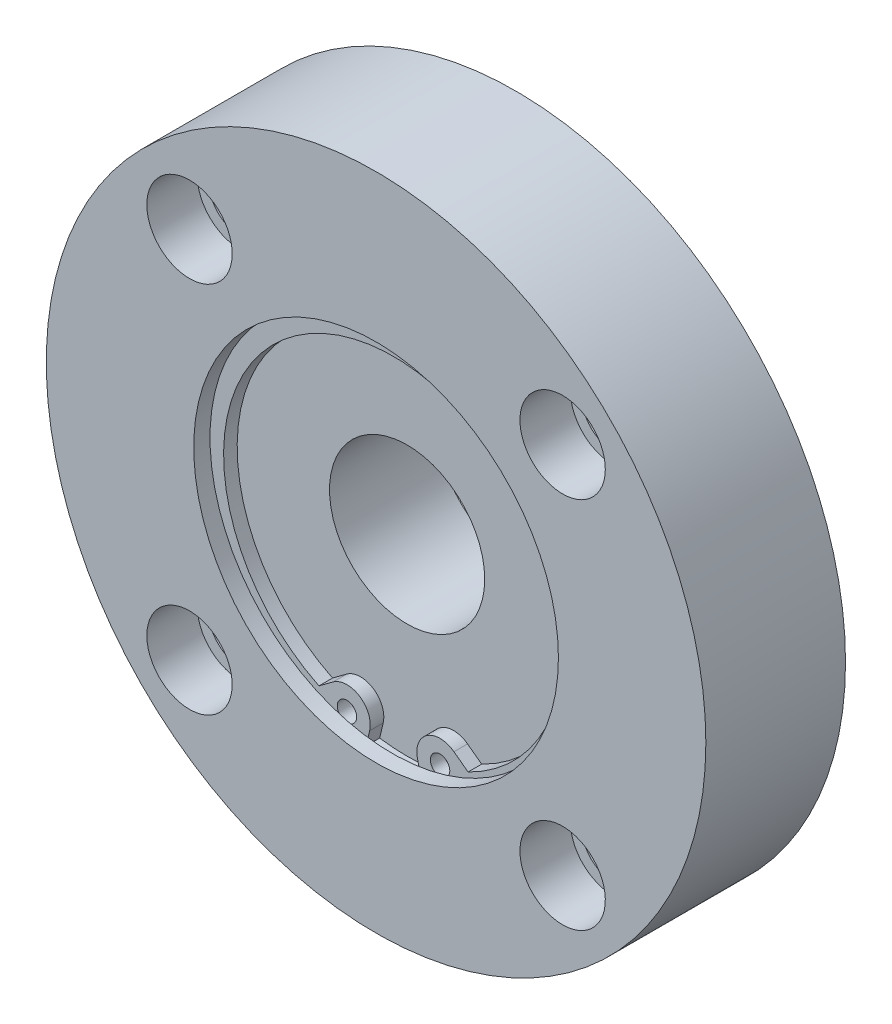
ISO-10303-21;
HEADER;
FILE_DESCRIPTION(('STEP AP214'),'2;1');
FILE_NAME('part.step','',(''),(''),'','','');
FILE_SCHEMA(('AUTOMOTIVE_DESIGN { 1 0 10303 214 1 1 1 1 }'));
ENDSEC;
DATA;
#1=APPLICATION_CONTEXT('core data for automotive mechanical design processes');
#2=APPLICATION_PROTOCOL_DEFINITION('international standard','automotive_design',2000,#1);
#3=PRODUCT_CONTEXT('',#1,'mechanical');
#4=PRODUCT('Part','Part','',(#3));
#5=PRODUCT_RELATED_PRODUCT_CATEGORY('part','',(#4));
#6=PRODUCT_DEFINITION_FORMATION('','',#4);
#7=PRODUCT_DEFINITION_CONTEXT('part definition',#1,'design');
#8=PRODUCT_DEFINITION('design','',#6,#7);
#9=PRODUCT_DEFINITION_SHAPE('','',#8);
#10=(LENGTH_UNIT() NAMED_UNIT(*) SI_UNIT(.MILLI.,.METRE.));
#11=(NAMED_UNIT(*) PLANE_ANGLE_UNIT() SI_UNIT($,.RADIAN.));
#12=(NAMED_UNIT(*) SI_UNIT($,.STERADIAN.) SOLID_ANGLE_UNIT());
#13=UNCERTAINTY_MEASURE_WITH_UNIT(LENGTH_MEASURE(1.E-05),#10,'distance_accuracy_value','');
#14=(GEOMETRIC_REPRESENTATION_CONTEXT(3) GLOBAL_UNCERTAINTY_ASSIGNED_CONTEXT((#13)) GLOBAL_UNIT_ASSIGNED_CONTEXT((#10,
#11,#12)) REPRESENTATION_CONTEXT('',''));
#15=CARTESIAN_POINT('',(0.,0.,0.));
#16=DIRECTION('',(0.,0.,1.));
#17=DIRECTION('',(1.,0.,0.));
#18=AXIS2_PLACEMENT_3D('',#15,#16,#17);
#19=CARTESIAN_POINT('',(24.0416305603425,24.0416305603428,0.));
#20=DIRECTION('',(0.,0.,1.));
#21=DIRECTION('',(1.,0.,0.));
#22=AXIS2_PLACEMENT_3D('',#19,#20,#21);
#23=CYLINDRICAL_SURFACE('',#22,4.);
#24=CARTESIAN_POINT('',(24.0416305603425,24.0416305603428,0.));
#25=DIRECTION('',(0.,0.,1.));
#26=DIRECTION('',(1.,0.,0.));
#27=AXIS2_PLACEMENT_3D('',#24,#25,#26);
#28=CIRCLE('',#27,4.);
#29=CARTESIAN_POINT('',(28.0416305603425,24.0416305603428,0.));
#30=VERTEX_POINT('',#29);
#31=EDGE_CURVE('E225',#30,#30,#28,.T.);
#32=ORIENTED_EDGE('',*,*,#31,.F.);
#33=EDGE_LOOP('',(#32));
#34=FACE_BOUND('',#33,.T.);
#35=CARTESIAN_POINT('',(24.0416305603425,24.0416305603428,11.5));
#36=DIRECTION('',(0.,0.,1.));
#37=DIRECTION('',(1.,0.,0.));
#38=AXIS2_PLACEMENT_3D('',#35,#36,#37);
#39=CIRCLE('',#38,4.);
#40=CARTESIAN_POINT('',(28.0416305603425,24.0416305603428,11.5));
#41=VERTEX_POINT('',#40);
#42=EDGE_CURVE('E224',#41,#41,#39,.F.);
#43=ORIENTED_EDGE('',*,*,#42,.F.);
#44=EDGE_LOOP('',(#43));
#45=FACE_BOUND('',#44,.T.);
#46=ADVANCED_FACE('F14',(#34,#45),#23,.F.);
#47=CARTESIAN_POINT('',(24.0416305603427,-24.0416305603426,0.));
#48=DIRECTION('',(0.,0.,1.));
#49=DIRECTION('',(1.,0.,0.));
#50=AXIS2_PLACEMENT_3D('',#47,#48,#49);
#51=CYLINDRICAL_SURFACE('',#50,4.);
#52=CARTESIAN_POINT('',(24.0416305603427,-24.0416305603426,0.));
#53=DIRECTION('',(0.,0.,1.));
#54=DIRECTION('',(0.,-1.,0.));
#55=AXIS2_PLACEMENT_3D('',#52,#53,#54);
#56=CIRCLE('',#55,4.);
#57=CARTESIAN_POINT('',(24.0416305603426,-28.0416305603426,0.));
#58=VERTEX_POINT('',#57);
#59=EDGE_CURVE('E215',#58,#58,#56,.T.);
#60=ORIENTED_EDGE('',*,*,#59,.F.);
#61=EDGE_LOOP('',(#60));
#62=FACE_BOUND('',#61,.T.);
#63=CARTESIAN_POINT('',(24.0416305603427,-24.0416305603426,11.5));
#64=DIRECTION('',(0.,0.,1.));
#65=DIRECTION('',(1.,0.,0.));
#66=AXIS2_PLACEMENT_3D('',#63,#64,#65);
#67=CIRCLE('',#66,4.);
#68=CARTESIAN_POINT('',(28.0416305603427,-24.0416305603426,11.5));
#69=VERTEX_POINT('',#68);
#70=EDGE_CURVE('E208',#69,#69,#67,.F.);
#71=ORIENTED_EDGE('',*,*,#70,.F.);
#72=EDGE_LOOP('',(#71));
#73=FACE_BOUND('',#72,.T.);
#74=ADVANCED_FACE('F339',(#62,#73),#51,.F.);
#75=CARTESIAN_POINT('',(-24.0416305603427,-24.0416305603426,0.));
#76=DIRECTION('',(0.,0.,1.));
#77=DIRECTION('',(1.,0.,0.));
#78=AXIS2_PLACEMENT_3D('',#75,#76,#77);
#79=CYLINDRICAL_SURFACE('',#78,4.);
#80=CARTESIAN_POINT('',(-24.0416305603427,-24.0416305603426,0.));
#81=DIRECTION('',(0.,0.,1.));
#82=DIRECTION('',(-1.,0.,0.));
#83=AXIS2_PLACEMENT_3D('',#80,#81,#82);
#84=CIRCLE('',#83,4.);
#85=CARTESIAN_POINT('',(-28.0416305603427,-24.0416305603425,0.));
#86=VERTEX_POINT('',#85);
#87=EDGE_CURVE('E212',#86,#86,#84,.T.);
#88=ORIENTED_EDGE('',*,*,#87,.F.);
#89=EDGE_LOOP('',(#88));
#90=FACE_BOUND('',#89,.T.);
#91=CARTESIAN_POINT('',(-24.0416305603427,-24.0416305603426,11.5));
#92=DIRECTION('',(0.,0.,1.));
#93=DIRECTION('',(1.,0.,0.));
#94=AXIS2_PLACEMENT_3D('',#91,#92,#93);
#95=CIRCLE('',#94,4.);
#96=CARTESIAN_POINT('',(-20.0416305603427,-24.0416305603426,11.5));
#97=VERTEX_POINT('',#96);
#98=EDGE_CURVE('E201',#97,#97,#95,.F.);
#99=ORIENTED_EDGE('',*,*,#98,.F.);
#100=EDGE_LOOP('',(#99));
#101=FACE_BOUND('',#100,.T.);
#102=ADVANCED_FACE('F352',(#90,#101),#79,.F.);
#103=CARTESIAN_POINT('',(-24.0416305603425,24.0416305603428,0.));
#104=DIRECTION('',(0.,0.,1.));
#105=DIRECTION('',(1.,0.,0.));
#106=AXIS2_PLACEMENT_3D('',#103,#104,#105);
#107=CYLINDRICAL_SURFACE('',#106,4.);
#108=CARTESIAN_POINT('',(-24.0416305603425,24.0416305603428,0.));
#109=DIRECTION('',(0.,0.,1.));
#110=DIRECTION('',(0.,1.,0.));
#111=AXIS2_PLACEMENT_3D('',#108,#109,#110);
#112=CIRCLE('',#111,4.);
#113=CARTESIAN_POINT('',(-24.0416305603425,28.0416305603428,0.));
#114=VERTEX_POINT('',#113);
#115=EDGE_CURVE('E209',#114,#114,#112,.T.);
#116=ORIENTED_EDGE('',*,*,#115,.F.);
#117=EDGE_LOOP('',(#116));
#118=FACE_BOUND('',#117,.T.);
#119=CARTESIAN_POINT('',(-24.0416305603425,24.0416305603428,11.5));
#120=DIRECTION('',(0.,0.,1.));
#121=DIRECTION('',(1.,0.,0.));
#122=AXIS2_PLACEMENT_3D('',#119,#120,#121);
#123=CIRCLE('',#122,4.);
#124=CARTESIAN_POINT('',(-20.0416305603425,24.0416305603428,11.5));
#125=VERTEX_POINT('',#124);
#126=EDGE_CURVE('E194',#125,#125,#123,.F.);
#127=ORIENTED_EDGE('',*,*,#126,.F.);
#128=EDGE_LOOP('',(#127));
#129=FACE_BOUND('',#128,.T.);
#130=ADVANCED_FACE('F356',(#118,#129),#107,.F.);
#131=CARTESIAN_POINT('',(0.,0.,-5.));
#132=DIRECTION('',(0.,0.,1.));
#133=DIRECTION('',(1.,0.,0.));
#134=AXIS2_PLACEMENT_3D('',#131,#132,#133);
#135=CYLINDRICAL_SURFACE('',#134,27.);
#136=CARTESIAN_POINT('',(0.,0.,-5.));
#137=DIRECTION('',(0.,0.,-1.));
#138=DIRECTION('',(-1.,0.,0.));
#139=AXIS2_PLACEMENT_3D('',#136,#137,#138);
#140=CIRCLE('',#139,27.);
#141=CARTESIAN_POINT('',(-27.,0.,-5.));
#142=VERTEX_POINT('',#141);
#143=EDGE_CURVE('E176',#142,#142,#140,.T.);
#144=ORIENTED_EDGE('',*,*,#143,.F.);
#145=EDGE_LOOP('',(#144));
#146=FACE_BOUND('',#145,.T.);
#147=CARTESIAN_POINT('',(0.,0.,0.));
#148=DIRECTION('',(0.,0.,-1.));
#149=DIRECTION('',(-1.,0.,0.));
#150=AXIS2_PLACEMENT_3D('',#147,#148,#149);
#151=CIRCLE('',#150,27.);
#152=CARTESIAN_POINT('',(-27.,0.,0.));
#153=VERTEX_POINT('',#152);
#154=EDGE_CURVE('E177',#153,#153,#151,.T.);
#155=ORIENTED_EDGE('',*,*,#154,.T.);
#156=EDGE_LOOP('',(#155));
#157=FACE_BOUND('',#156,.T.);
#158=ADVANCED_FACE('F360',(#146,#157),#135,.T.);
#159=CARTESIAN_POINT('',(0.,0.,0.));
#160=DIRECTION('',(0.,0.,1.));
#161=DIRECTION('',(1.,0.,0.));
#162=AXIS2_PLACEMENT_3D('',#159,#160,#161);
#163=PLANE('',#162);
#164=ORIENTED_EDGE('',*,*,#115,.T.);
#165=EDGE_LOOP('',(#164));
#166=FACE_BOUND('',#165,.T.);
#167=ORIENTED_EDGE('',*,*,#87,.T.);
#168=EDGE_LOOP('',(#167));
#169=FACE_BOUND('',#168,.T.);
#170=ORIENTED_EDGE('',*,*,#59,.T.);
#171=EDGE_LOOP('',(#170));
#172=FACE_BOUND('',#171,.T.);
#173=ORIENTED_EDGE('',*,*,#31,.T.);
#174=EDGE_LOOP('',(#173));
#175=FACE_BOUND('',#174,.T.);
#176=CARTESIAN_POINT('',(0.,0.,0.));
#177=DIRECTION('',(0.,0.,1.));
#178=DIRECTION('',(1.,0.,0.));
#179=AXIS2_PLACEMENT_3D('',#176,#177,#178);
#180=CIRCLE('',#179,42.5);
#181=CARTESIAN_POINT('',(42.5,0.,0.));
#182=VERTEX_POINT('',#181);
#183=EDGE_CURVE('E231',#182,#182,#180,.T.);
#184=ORIENTED_EDGE('',*,*,#183,.F.);
#185=EDGE_LOOP('',(#184));
#186=FACE_BOUND('',#185,.T.);
#187=ORIENTED_EDGE('',*,*,#154,.F.);
#188=EDGE_LOOP('',(#187));
#189=FACE_BOUND('',#188,.T.);
#190=ADVANCED_FACE('F332',(#166,#169,#172,#175,#186,#189),#163,.F.);
#191=CARTESIAN_POINT('',(24.0416305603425,24.0416305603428,11.5));
#192=DIRECTION('',(0.,0.,1.));
#193=DIRECTION('',(1.,0.,0.));
#194=AXIS2_PLACEMENT_3D('',#191,#192,#193);
#195=PLANE('',#194);
#196=CARTESIAN_POINT('',(24.0416305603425,24.0416305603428,11.5));
#197=DIRECTION('',(0.,0.,1.));
#198=DIRECTION('',(1.,0.,0.));
#199=AXIS2_PLACEMENT_3D('',#196,#197,#198);
#200=CIRCLE('',#199,5.5);
#201=CARTESIAN_POINT('',(29.5416305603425,24.0416305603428,11.5));
#202=VERTEX_POINT('',#201);
#203=EDGE_CURVE('E221',#202,#202,#200,.T.);
#204=ORIENTED_EDGE('',*,*,#203,.T.);
#205=EDGE_LOOP('',(#204));
#206=FACE_BOUND('',#205,.T.);
#207=ORIENTED_EDGE('',*,*,#42,.T.);
#208=EDGE_LOOP('',(#207));
#209=FACE_BOUND('',#208,.T.);
#210=ADVANCED_FACE('F345',(#206,#209),#195,.T.);
#211=CARTESIAN_POINT('',(24.0416305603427,-24.0416305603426,11.5));
#212=DIRECTION('',(0.,0.,1.));
#213=DIRECTION('',(0.,-1.,0.));
#214=AXIS2_PLACEMENT_3D('',#211,#212,#213);
#215=PLANE('',#214);
#216=CARTESIAN_POINT('',(24.0416305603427,-24.0416305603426,11.5));
#217=DIRECTION('',(0.,0.,1.));
#218=DIRECTION('',(0.,-1.,0.));
#219=AXIS2_PLACEMENT_3D('',#216,#217,#218);
#220=CIRCLE('',#219,5.5);
#221=CARTESIAN_POINT('',(24.0416305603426,-29.5416305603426,11.5));
#222=VERTEX_POINT('',#221);
#223=EDGE_CURVE('E205',#222,#222,#220,.T.);
#224=ORIENTED_EDGE('',*,*,#223,.T.);
#225=EDGE_LOOP('',(#224));
#226=FACE_BOUND('',#225,.T.);
#227=ORIENTED_EDGE('',*,*,#70,.T.);
#228=EDGE_LOOP('',(#227));
#229=FACE_BOUND('',#228,.T.);
#230=ADVANCED_FACE('F348',(#226,#229),#215,.T.);
#231=CARTESIAN_POINT('',(-24.0416305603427,-24.0416305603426,11.5));
#232=DIRECTION('',(0.,0.,1.));
#233=DIRECTION('',(-1.,0.,0.));
#234=AXIS2_PLACEMENT_3D('',#231,#232,#233);
#235=PLANE('',#234);
#236=CARTESIAN_POINT('',(-24.0416305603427,-24.0416305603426,11.5));
#237=DIRECTION('',(0.,0.,1.));
#238=DIRECTION('',(-1.,0.,0.));
#239=AXIS2_PLACEMENT_3D('',#236,#237,#238);
#240=CIRCLE('',#239,5.5);
#241=CARTESIAN_POINT('',(-29.5416305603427,-24.0416305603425,11.5));
#242=VERTEX_POINT('',#241);
#243=EDGE_CURVE('E198',#242,#242,#240,.T.);
#244=ORIENTED_EDGE('',*,*,#243,.T.);
#245=EDGE_LOOP('',(#244));
#246=FACE_BOUND('',#245,.T.);
#247=ORIENTED_EDGE('',*,*,#98,.T.);
#248=EDGE_LOOP('',(#247));
#249=FACE_BOUND('',#248,.T.);
#250=ADVANCED_FACE('F368',(#246,#249),#235,.T.);
#251=CARTESIAN_POINT('',(-24.0416305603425,24.0416305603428,11.5));
#252=DIRECTION('',(0.,0.,1.));
#253=DIRECTION('',(0.,1.,0.));
#254=AXIS2_PLACEMENT_3D('',#251,#252,#253);
#255=PLANE('',#254);
#256=CARTESIAN_POINT('',(-24.0416305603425,24.0416305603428,11.5));
#257=DIRECTION('',(0.,0.,1.));
#258=DIRECTION('',(0.,1.,0.));
#259=AXIS2_PLACEMENT_3D('',#256,#257,#258);
#260=CIRCLE('',#259,5.5);
#261=CARTESIAN_POINT('',(-24.0416305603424,29.5416305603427,11.5));
#262=VERTEX_POINT('',#261);
#263=EDGE_CURVE('E191',#262,#262,#260,.T.);
#264=ORIENTED_EDGE('',*,*,#263,.T.);
#265=EDGE_LOOP('',(#264));
#266=FACE_BOUND('',#265,.T.);
#267=ORIENTED_EDGE('',*,*,#126,.T.);
#268=EDGE_LOOP('',(#267));
#269=FACE_BOUND('',#268,.T.);
#270=ADVANCED_FACE('F376',(#266,#269),#255,.T.);
#271=CARTESIAN_POINT('',(0.,0.,-5.));
#272=DIRECTION('',(0.,0.,-1.));
#273=DIRECTION('',(-1.,0.,0.));
#274=AXIS2_PLACEMENT_3D('',#271,#272,#273);
#275=PLANE('',#274);
#276=ORIENTED_EDGE('',*,*,#143,.T.);
#277=EDGE_LOOP('',(#276));
#278=FACE_BOUND('',#277,.T.);
#279=CARTESIAN_POINT('',(0.,0.,-5.));
#280=DIRECTION('',(0.,0.,-1.));
#281=DIRECTION('',(-1.,0.,0.));
#282=AXIS2_PLACEMENT_3D('',#279,#280,#281);
#283=CIRCLE('',#282,20.);
#284=CARTESIAN_POINT('',(-20.,0.,-5.));
#285=VERTEX_POINT('',#284);
#286=EDGE_CURVE('E173',#285,#285,#283,.T.);
#287=ORIENTED_EDGE('',*,*,#286,.F.);
#288=EDGE_LOOP('',(#287));
#289=FACE_BOUND('',#288,.T.);
#290=ADVANCED_FACE('F320',(#278,#289),#275,.T.);
#291=CARTESIAN_POINT('',(0.,0.,18.));
#292=DIRECTION('',(0.,0.,-1.));
#293=DIRECTION('',(-1.,0.,0.));
#294=AXIS2_PLACEMENT_3D('',#291,#292,#293);
#295=CYLINDRICAL_SURFACE('',#294,42.5);
#296=CARTESIAN_POINT('',(0.,0.,18.));
#297=DIRECTION('',(0.,0.,1.));
#298=DIRECTION('',(1.,0.,0.));
#299=AXIS2_PLACEMENT_3D('',#296,#297,#298);
#300=CIRCLE('',#299,42.5);
#301=CARTESIAN_POINT('',(42.5,0.,18.));
#302=VERTEX_POINT('',#301);
#303=EDGE_CURVE('E181',#302,#302,#300,.T.);
#304=ORIENTED_EDGE('',*,*,#303,.F.);
#305=EDGE_LOOP('',(#304));
#306=FACE_BOUND('',#305,.T.);
#307=ORIENTED_EDGE('',*,*,#183,.T.);
#308=EDGE_LOOP('',(#307));
#309=FACE_BOUND('',#308,.T.);
#310=ADVANCED_FACE('F316',(#306,#309),#295,.T.);
#311=CARTESIAN_POINT('',(24.0416305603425,24.0416305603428,11.5));
#312=DIRECTION('',(0.,0.,1.));
#313=DIRECTION('',(1.,0.,0.));
#314=AXIS2_PLACEMENT_3D('',#311,#312,#313);
#315=CYLINDRICAL_SURFACE('',#314,5.5);
#316=ORIENTED_EDGE('',*,*,#203,.F.);
#317=EDGE_LOOP('',(#316));
#318=FACE_BOUND('',#317,.T.);
#319=CARTESIAN_POINT('',(24.0416305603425,24.0416305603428,18.));
#320=DIRECTION('',(0.,0.,1.));
#321=DIRECTION('',(1.,0.,0.));
#322=AXIS2_PLACEMENT_3D('',#319,#320,#321);
#323=CIRCLE('',#322,5.5);
#324=CARTESIAN_POINT('',(29.5416305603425,24.0416305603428,18.));
#325=VERTEX_POINT('',#324);
#326=EDGE_CURVE('E218',#325,#325,#323,.T.);
#327=ORIENTED_EDGE('',*,*,#326,.T.);
#328=EDGE_LOOP('',(#327));
#329=FACE_BOUND('',#328,.T.);
#330=ADVANCED_FACE('F319',(#318,#329),#315,.F.);
#331=CARTESIAN_POINT('',(24.0416305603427,-24.0416305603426,11.5));
#332=DIRECTION('',(0.,0.,1.));
#333=DIRECTION('',(1.,0.,0.));
#334=AXIS2_PLACEMENT_3D('',#331,#332,#333);
#335=CYLINDRICAL_SURFACE('',#334,5.5);
#336=ORIENTED_EDGE('',*,*,#223,.F.);
#337=EDGE_LOOP('',(#336));
#338=FACE_BOUND('',#337,.T.);
#339=CARTESIAN_POINT('',(24.0416305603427,-24.0416305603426,18.));
#340=DIRECTION('',(0.,0.,1.));
#341=DIRECTION('',(0.,-1.,0.));
#342=AXIS2_PLACEMENT_3D('',#339,#340,#341);
#343=CIRCLE('',#342,5.5);
#344=CARTESIAN_POINT('',(24.0416305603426,-29.5416305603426,18.));
#345=VERTEX_POINT('',#344);
#346=EDGE_CURVE('E202',#345,#345,#343,.T.);
#347=ORIENTED_EDGE('',*,*,#346,.T.);
#348=EDGE_LOOP('',(#347));
#349=FACE_BOUND('',#348,.T.);
#350=ADVANCED_FACE('F343',(#338,#349),#335,.F.);
#351=CARTESIAN_POINT('',(-24.0416305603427,-24.0416305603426,11.5));
#352=DIRECTION('',(0.,0.,1.));
#353=DIRECTION('',(1.,0.,0.));
#354=AXIS2_PLACEMENT_3D('',#351,#352,#353);
#355=CYLINDRICAL_SURFACE('',#354,5.5);
#356=ORIENTED_EDGE('',*,*,#243,.F.);
#357=EDGE_LOOP('',(#356));
#358=FACE_BOUND('',#357,.T.);
#359=CARTESIAN_POINT('',(-24.0416305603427,-24.0416305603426,18.));
#360=DIRECTION('',(0.,0.,1.));
#361=DIRECTION('',(-1.,0.,0.));
#362=AXIS2_PLACEMENT_3D('',#359,#360,#361);
#363=CIRCLE('',#362,5.5);
#364=CARTESIAN_POINT('',(-29.5416305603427,-24.0416305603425,18.));
#365=VERTEX_POINT('',#364);
#366=EDGE_CURVE('E195',#365,#365,#363,.T.);
#367=ORIENTED_EDGE('',*,*,#366,.T.);
#368=EDGE_LOOP('',(#367));
#369=FACE_BOUND('',#368,.T.);
#370=ADVANCED_FACE('F364',(#358,#369),#355,.F.);
#371=CARTESIAN_POINT('',(-24.0416305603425,24.0416305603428,11.5));
#372=DIRECTION('',(0.,0.,1.));
#373=DIRECTION('',(1.,0.,0.));
#374=AXIS2_PLACEMENT_3D('',#371,#372,#373);
#375=CYLINDRICAL_SURFACE('',#374,5.5);
#376=ORIENTED_EDGE('',*,*,#263,.F.);
#377=EDGE_LOOP('',(#376));
#378=FACE_BOUND('',#377,.T.);
#379=CARTESIAN_POINT('',(-24.0416305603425,24.0416305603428,18.));
#380=DIRECTION('',(0.,0.,1.));
#381=DIRECTION('',(0.,1.,0.));
#382=AXIS2_PLACEMENT_3D('',#379,#380,#381);
#383=CIRCLE('',#382,5.5);
#384=CARTESIAN_POINT('',(-24.0416305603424,29.5416305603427,18.));
#385=VERTEX_POINT('',#384);
#386=EDGE_CURVE('E188',#385,#385,#383,.T.);
#387=ORIENTED_EDGE('',*,*,#386,.T.);
#388=EDGE_LOOP('',(#387));
#389=FACE_BOUND('',#388,.T.);
#390=ADVANCED_FACE('F372',(#378,#389),#375,.F.);
#391=CARTESIAN_POINT('',(0.,0.,-5.));
#392=DIRECTION('',(0.,0.,1.));
#393=DIRECTION('',(1.,0.,0.));
#394=AXIS2_PLACEMENT_3D('',#391,#392,#393);
#395=CYLINDRICAL_SURFACE('',#394,20.);
#396=ORIENTED_EDGE('',*,*,#286,.T.);
#397=EDGE_LOOP('',(#396));
#398=FACE_BOUND('',#397,.T.);
#399=CARTESIAN_POINT('',(0.,0.,0.));
#400=DIRECTION('',(0.,0.,-1.));
#401=DIRECTION('',(-1.,0.,0.));
#402=AXIS2_PLACEMENT_3D('',#399,#400,#401);
#403=CIRCLE('',#402,20.);
#404=CARTESIAN_POINT('',(-20.,0.,0.));
#405=VERTEX_POINT('',#404);
#406=EDGE_CURVE('E170',#405,#405,#403,.T.);
#407=ORIENTED_EDGE('',*,*,#406,.F.);
#408=EDGE_LOOP('',(#407));
#409=FACE_BOUND('',#408,.T.);
#410=ADVANCED_FACE('F326',(#398,#409),#395,.F.);
#411=CARTESIAN_POINT('',(0.,0.,18.));
#412=DIRECTION('',(0.,0.,1.));
#413=DIRECTION('',(1.,0.,0.));
#414=AXIS2_PLACEMENT_3D('',#411,#412,#413);
#415=PLANE('',#414);
#416=CARTESIAN_POINT('',(0.,0.,18.));
#417=DIRECTION('',(0.,0.,1.));
#418=DIRECTION('',(1.,0.,0.));
#419=AXIS2_PLACEMENT_3D('',#416,#417,#418);
#420=CIRCLE('',#419,23.5);
#421=CARTESIAN_POINT('',(23.5,0.,18.));
#422=VERTEX_POINT('',#421);
#423=EDGE_CURVE('E184',#422,#422,#420,.T.);
#424=ORIENTED_EDGE('',*,*,#423,.F.);
#425=EDGE_LOOP('',(#424));
#426=FACE_BOUND('',#425,.T.);
#427=ORIENTED_EDGE('',*,*,#386,.F.);
#428=EDGE_LOOP('',(#427));
#429=FACE_BOUND('',#428,.T.);
#430=ORIENTED_EDGE('',*,*,#366,.F.);
#431=EDGE_LOOP('',(#430));
#432=FACE_BOUND('',#431,.T.);
#433=ORIENTED_EDGE('',*,*,#346,.F.);
#434=EDGE_LOOP('',(#433));
#435=FACE_BOUND('',#434,.T.);
#436=ORIENTED_EDGE('',*,*,#326,.F.);
#437=EDGE_LOOP('',(#436));
#438=FACE_BOUND('',#437,.T.);
#439=ORIENTED_EDGE('',*,*,#303,.T.);
#440=EDGE_LOOP('',(#439));
#441=FACE_BOUND('',#440,.T.);
#442=ADVANCED_FACE('F322',(#426,#429,#432,#435,#438,#441),#415,.T.);
#443=ORIENTED_EDGE('',*,*,#406,.T.);
#444=EDGE_LOOP('',(#443));
#445=FACE_BOUND('',#444,.T.);
#446=CARTESIAN_POINT('',(0.,0.,0.));
#447=DIRECTION('',(0.,0.,1.));
#448=DIRECTION('',(1.,0.,0.));
#449=AXIS2_PLACEMENT_3D('',#446,#447,#448);
#450=CIRCLE('',#449,10.);
#451=CARTESIAN_POINT('',(10.,0.,0.));
#452=VERTEX_POINT('',#451);
#453=EDGE_CURVE('E228',#452,#452,#450,.T.);
#454=ORIENTED_EDGE('',*,*,#453,.T.);
#455=EDGE_LOOP('',(#454));
#456=FACE_BOUND('',#455,.T.);
#457=ADVANCED_FACE('F325',(#445,#456),#163,.F.);
#458=CARTESIAN_POINT('',(0.,0.,14.));
#459=DIRECTION('',(0.,0.,1.));
#460=DIRECTION('',(1.,0.,0.));
#461=AXIS2_PLACEMENT_3D('',#458,#459,#460);
#462=CYLINDRICAL_SURFACE('',#461,23.5);
#463=CARTESIAN_POINT('',(0.,0.,15.9));
#464=DIRECTION('',(0.,0.,1.));
#465=DIRECTION('',(1.,0.,0.));
#466=AXIS2_PLACEMENT_3D('',#463,#464,#465);
#467=CIRCLE('',#466,23.5);
#468=CARTESIAN_POINT('',(23.5,0.,15.9));
#469=VERTEX_POINT('',#468);
#470=EDGE_CURVE('E167',#469,#469,#467,.F.);
#471=ORIENTED_EDGE('',*,*,#470,.T.);
#472=EDGE_LOOP('',(#471));
#473=FACE_BOUND('',#472,.T.);
#474=ORIENTED_EDGE('',*,*,#423,.T.);
#475=EDGE_LOOP('',(#474));
#476=FACE_BOUND('',#475,.T.);
#477=ADVANCED_FACE('F330',(#473,#476),#462,.F.);
#478=CARTESIAN_POINT('',(0.,0.,18.));
#479=DIRECTION('',(0.,0.,-1.));
#480=DIRECTION('',(-1.,0.,0.));
#481=AXIS2_PLACEMENT_3D('',#478,#479,#480);
#482=CYLINDRICAL_SURFACE('',#481,10.);
#483=ORIENTED_EDGE('',*,*,#453,.F.);
#484=EDGE_LOOP('',(#483));
#485=FACE_BOUND('',#484,.T.);
#486=CARTESIAN_POINT('',(0.,0.,14.));
#487=DIRECTION('',(0.,0.,1.));
#488=DIRECTION('',(1.,0.,0.));
#489=AXIS2_PLACEMENT_3D('',#486,#487,#488);
#490=CIRCLE('',#489,10.);
#491=CARTESIAN_POINT('',(10.,0.,14.));
#492=VERTEX_POINT('',#491);
#493=EDGE_CURVE('E187',#492,#492,#490,.T.);
#494=ORIENTED_EDGE('',*,*,#493,.T.);
#495=EDGE_LOOP('',(#494));
#496=FACE_BOUND('',#495,.T.);
#497=ADVANCED_FACE('F333',(#485,#496),#482,.F.);
#498=CARTESIAN_POINT('',(0.,0.,14.));
#499=DIRECTION('',(0.,0.,1.));
#500=DIRECTION('',(1.,0.,0.));
#501=AXIS2_PLACEMENT_3D('',#498,#499,#500);
#502=PLANE('',#501);
#503=ORIENTED_EDGE('',*,*,#493,.F.);
#504=EDGE_LOOP('',(#503));
#505=FACE_BOUND('',#504,.T.);
#506=CARTESIAN_POINT('',(0.,0.,14.));
#507=DIRECTION('',(0.,0.,1.));
#508=DIRECTION('',(1.,0.,0.));
#509=AXIS2_PLACEMENT_3D('',#506,#507,#508);
#510=CIRCLE('',#509,24.75);
#511=CARTESIAN_POINT('',(-3.53738888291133,-24.4959053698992,14.));
#512=VERTEX_POINT('',#511);
#513=CARTESIAN_POINT('',(3.53738888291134,-24.4959053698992,14.));
#514=VERTEX_POINT('',#513);
#515=EDGE_CURVE('E157',#512,#514,#510,.T.);
#516=ORIENTED_EDGE('',*,*,#515,.T.);
#517=DIRECTION('',(-0.231349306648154,0.972870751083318,0.));
#518=VECTOR('',#517,1.);
#519=CARTESIAN_POINT('',(-2.16530728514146,-0.514911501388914,14.));
#520=LINE('',#519,#518);
#521=CARTESIAN_POINT('',(3.08138774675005,-22.5783281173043,14.));
#522=VERTEX_POINT('',#521);
#523=EDGE_CURVE('E9',#514,#522,#520,.T.);
#524=ORIENTED_EDGE('',*,*,#523,.T.);
#525=CARTESIAN_POINT('',(6.,-21.8842801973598,14.));
#526=DIRECTION('',(0.,0.,1.));
#527=DIRECTION('',(1.,0.,0.));
#528=AXIS2_PLACEMENT_3D('',#525,#526,#527);
#529=CIRCLE('',#528,3.);
#530=CARTESIAN_POINT('',(7.7896612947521,-19.4765608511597,14.));
#531=VERTEX_POINT('',#530);
#532=EDGE_CURVE('E25',#531,#522,#529,.T.);
#533=ORIENTED_EDGE('',*,*,#532,.F.);
#534=DIRECTION('',(0.802573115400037,-0.596553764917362,0.));
#535=VECTOR('',#534,1.);
#536=CARTESIAN_POINT('',(-6.55279254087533,-8.81579403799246,14.));
#537=LINE('',#536,#535);
#538=CARTESIAN_POINT('',(9.60938951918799,-20.8291674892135,14.));
#539=VERTEX_POINT('',#538);
#540=EDGE_CURVE('E101',#531,#539,#537,.T.);
#541=ORIENTED_EDGE('',*,*,#540,.T.);
#542=CARTESIAN_POINT('',(0.,-1.15,14.));
#543=DIRECTION('',(0.,0.,1.));
#544=DIRECTION('',(1.,0.,0.));
#545=AXIS2_PLACEMENT_3D('',#542,#543,#544);
#546=CIRCLE('',#545,21.9);
#547=CARTESIAN_POINT('',(-9.60938951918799,-20.8291674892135,14.));
#548=VERTEX_POINT('',#547);
#549=EDGE_CURVE('E104',#539,#548,#546,.T.);
#550=ORIENTED_EDGE('',*,*,#549,.T.);
#551=DIRECTION('',(0.802573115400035,0.596553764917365,0.));
#552=VECTOR('',#551,1.);
#553=CARTESIAN_POINT('',(6.55279254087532,-8.81579403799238,14.));
#554=LINE('',#553,#552);
#555=CARTESIAN_POINT('',(-7.7896612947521,-19.4765608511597,14.));
#556=VERTEX_POINT('',#555);
#557=EDGE_CURVE('E119',#548,#556,#554,.T.);
#558=ORIENTED_EDGE('',*,*,#557,.T.);
#559=CARTESIAN_POINT('',(-6.,-21.8842801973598,14.));
#560=DIRECTION('',(0.,0.,1.));
#561=DIRECTION('',(1.,0.,0.));
#562=AXIS2_PLACEMENT_3D('',#559,#560,#561);
#563=CIRCLE('',#562,3.);
#564=CARTESIAN_POINT('',(-3.08138774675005,-22.5783281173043,14.));
#565=VERTEX_POINT('',#564);
#566=EDGE_CURVE('E261',#565,#556,#563,.T.);
#567=ORIENTED_EDGE('',*,*,#566,.F.);
#568=DIRECTION('',(-0.231349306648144,-0.97287075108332,0.));
#569=VECTOR('',#568,1.);
#570=CARTESIAN_POINT('',(2.16530728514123,-0.514911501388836,14.));
#571=LINE('',#570,#569);
#572=EDGE_CURVE('E74',#565,#512,#571,.T.);
#573=ORIENTED_EDGE('',*,*,#572,.T.);
#574=EDGE_LOOP('',(#516,#524,#533,#541,#550,#558,#567,#573));
#575=FACE_BOUND('',#574,.T.);
#576=ADVANCED_FACE('F103',(#505,#575),#502,.T.);
#577=CARTESIAN_POINT('',(0.,0.,15.9));
#578=DIRECTION('',(0.,0.,1.));
#579=DIRECTION('',(1.,0.,0.));
#580=AXIS2_PLACEMENT_3D('',#577,#578,#579);
#581=PLANE('',#580);
#582=CARTESIAN_POINT('',(0.,0.,15.9));
#583=DIRECTION('',(0.,0.,1.));
#584=DIRECTION('',(1.,0.,0.));
#585=AXIS2_PLACEMENT_3D('',#582,#583,#584);
#586=CIRCLE('',#585,24.75);
#587=CARTESIAN_POINT('',(24.75,0.,15.9));
#588=VERTEX_POINT('',#587);
#589=EDGE_CURVE('E163',#588,#588,#586,.T.);
#590=ORIENTED_EDGE('',*,*,#589,.F.);
#591=EDGE_LOOP('',(#590));
#592=FACE_BOUND('',#591,.T.);
#593=ORIENTED_EDGE('',*,*,#470,.F.);
#594=EDGE_LOOP('',(#593));
#595=FACE_BOUND('',#594,.T.);
#596=ADVANCED_FACE('F388',(#592,#595),#581,.F.);
#597=CARTESIAN_POINT('',(0.,0.,15.9));
#598=DIRECTION('',(0.,0.,-1.));
#599=DIRECTION('',(-1.,0.,0.));
#600=AXIS2_PLACEMENT_3D('',#597,#598,#599);
#601=CYLINDRICAL_SURFACE('',#600,24.75);
#602=ORIENTED_EDGE('',*,*,#589,.T.);
#603=EDGE_LOOP('',(#602));
#604=FACE_BOUND('',#603,.T.);
#605=CARTESIAN_POINT('',(0.,0.,15.75));
#606=DIRECTION('',(0.,0.,1.));
#607=DIRECTION('',(1.,0.,0.));
#608=AXIS2_PLACEMENT_3D('',#605,#606,#607);
#609=CIRCLE('',#608,24.75);
#610=CARTESIAN_POINT('',(3.53738888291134,-24.4959053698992,15.75));
#611=VERTEX_POINT('',#610);
#612=CARTESIAN_POINT('',(-3.53738888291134,-24.4959053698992,15.75));
#613=VERTEX_POINT('',#612);
#614=EDGE_CURVE('E180',#611,#613,#609,.T.);
#615=ORIENTED_EDGE('',*,*,#614,.F.);
#616=DIRECTION('',(0.,0.,-1.));
#617=VECTOR('',#616,1.);
#618=CARTESIAN_POINT('',(3.53738888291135,-24.4959053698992,15.9));
#619=LINE('',#618,#617);
#620=EDGE_CURVE('E251',#611,#514,#619,.T.);
#621=ORIENTED_EDGE('',*,*,#620,.T.);
#622=ORIENTED_EDGE('',*,*,#515,.F.);
#623=DIRECTION('',(0.,0.,-1.));
#624=VECTOR('',#623,1.);
#625=CARTESIAN_POINT('',(-3.53738888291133,-24.4959053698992,15.9));
#626=LINE('',#625,#624);
#627=EDGE_CURVE('E249',#512,#613,#626,.F.);
#628=ORIENTED_EDGE('',*,*,#627,.T.);
#629=EDGE_LOOP('',(#615,#621,#622,#628));
#630=FACE_BOUND('',#629,.T.);
#631=ADVANCED_FACE('F399',(#604,#630),#601,.F.);
#632=CARTESIAN_POINT('',(6.,-21.8842801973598,14.));
#633=DIRECTION('',(0.,0.,1.));
#634=DIRECTION('',(1.,0.,0.));
#635=AXIS2_PLACEMENT_3D('',#632,#633,#634);
#636=CIRCLE('',#635,1.25);
#637=CARTESIAN_POINT('',(7.25,-21.8842801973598,14.));
#638=VERTEX_POINT('',#637);
#639=EDGE_CURVE('E254',#638,#638,#636,.T.);
#640=ORIENTED_EDGE('',*,*,#639,.T.);
#641=EDGE_LOOP('',(#640));
#642=FACE_BOUND('',#641,.T.);
#643=ADVANCED_FACE('F287',(#642),#502,.T.);
#644=CARTESIAN_POINT('',(-6.,-21.8842801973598,14.));
#645=DIRECTION('',(0.,0.,1.));
#646=DIRECTION('',(1.,0.,0.));
#647=AXIS2_PLACEMENT_3D('',#644,#645,#646);
#648=CIRCLE('',#647,1.25);
#649=CARTESIAN_POINT('',(-4.75,-21.8842801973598,14.));
#650=VERTEX_POINT('',#649);
#651=EDGE_CURVE('E257',#650,#650,#648,.T.);
#652=ORIENTED_EDGE('',*,*,#651,.T.);
#653=EDGE_LOOP('',(#652));
#654=FACE_BOUND('',#653,.T.);
#655=ADVANCED_FACE('F281',(#654),#502,.T.);
#656=CARTESIAN_POINT('',(6.,-21.8842801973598,15.8));
#657=DIRECTION('',(0.,0.,1.));
#658=DIRECTION('',(-1.,0.,0.));
#659=AXIS2_PLACEMENT_3D('',#656,#657,#658);
#660=CYLINDRICAL_SURFACE('',#659,3.);
#661=DIRECTION('',(0.,0.,-1.));
#662=VECTOR('',#661,1.);
#663=CARTESIAN_POINT('',(3.08138774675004,-22.5783281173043,15.8));
#664=LINE('',#663,#662);
#665=CARTESIAN_POINT('',(3.08138774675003,-22.5783281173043,15.75));
#666=VERTEX_POINT('',#665);
#667=EDGE_CURVE('E131',#666,#522,#664,.T.);
#668=ORIENTED_EDGE('',*,*,#667,.F.);
#669=CARTESIAN_POINT('',(6.,-21.8842801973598,15.75));
#670=DIRECTION('',(0.,0.,1.));
#671=DIRECTION('',(1.,0.,0.));
#672=AXIS2_PLACEMENT_3D('',#669,#670,#671);
#673=CIRCLE('',#672,3.);
#674=CARTESIAN_POINT('',(7.7896612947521,-19.4765608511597,15.75));
#675=VERTEX_POINT('',#674);
#676=EDGE_CURVE('E59',#675,#666,#673,.T.);
#677=ORIENTED_EDGE('',*,*,#676,.F.);
#678=DIRECTION('',(0.,0.,-1.));
#679=VECTOR('',#678,1.);
#680=CARTESIAN_POINT('',(7.7896612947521,-19.4765608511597,15.8));
#681=LINE('',#680,#679);
#682=EDGE_CURVE('E124',#675,#531,#681,.T.);
#683=ORIENTED_EDGE('',*,*,#682,.T.);
#684=ORIENTED_EDGE('',*,*,#532,.T.);
#685=EDGE_LOOP('',(#668,#677,#683,#684));
#686=FACE_BOUND('',#685,.T.);
#687=ADVANCED_FACE('F279',(#686),#660,.T.);
#688=CARTESIAN_POINT('',(7.7896612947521,-19.4765608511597,15.8));
#689=DIRECTION('',(-0.596553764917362,-0.802573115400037,0.));
#690=DIRECTION('',(-0.802573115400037,0.596553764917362,0.));
#691=AXIS2_PLACEMENT_3D('',#688,#689,#690);
#692=PLANE('',#691);
#693=DIRECTION('',(-0.802573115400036,0.596553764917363,0.));
#694=VECTOR('',#693,1.);
#695=CARTESIAN_POINT('',(9.60938951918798,-20.8291674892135,15.75));
#696=LINE('',#695,#694);
#697=CARTESIAN_POINT('',(9.60938951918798,-20.8291674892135,15.75));
#698=VERTEX_POINT('',#697);
#699=EDGE_CURVE('E122',#698,#675,#696,.T.);
#700=ORIENTED_EDGE('',*,*,#699,.F.);
#701=DIRECTION('',(0.,0.,-1.));
#702=VECTOR('',#701,1.);
#703=CARTESIAN_POINT('',(9.60938951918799,-20.8291674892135,15.8));
#704=LINE('',#703,#702);
#705=EDGE_CURVE('E115',#698,#539,#704,.T.);
#706=ORIENTED_EDGE('',*,*,#705,.T.);
#707=ORIENTED_EDGE('',*,*,#540,.F.);
#708=ORIENTED_EDGE('',*,*,#682,.F.);
#709=EDGE_LOOP('',(#700,#706,#707,#708));
#710=FACE_BOUND('',#709,.T.);
#711=ADVANCED_FACE('F16',(#710),#692,.F.);
#712=CARTESIAN_POINT('',(0.,-1.15,15.8));
#713=DIRECTION('',(0.,0.,1.));
#714=DIRECTION('',(-1.,0.,0.));
#715=AXIS2_PLACEMENT_3D('',#712,#713,#714);
#716=CYLINDRICAL_SURFACE('',#715,21.9);
#717=CARTESIAN_POINT('',(0.,-1.15,15.75));
#718=DIRECTION('',(0.,0.,-1.));
#719=DIRECTION('',(1.,0.,0.));
#720=AXIS2_PLACEMENT_3D('',#717,#718,#719);
#721=CIRCLE('',#720,21.9);
#722=CARTESIAN_POINT('',(-9.60938951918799,-20.8291674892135,15.75));
#723=VERTEX_POINT('',#722);
#724=EDGE_CURVE('E272',#723,#698,#721,.T.);
#725=ORIENTED_EDGE('',*,*,#724,.F.);
#726=DIRECTION('',(0.,0.,-1.));
#727=VECTOR('',#726,1.);
#728=CARTESIAN_POINT('',(-9.60938951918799,-20.8291674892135,15.8));
#729=LINE('',#728,#727);
#730=EDGE_CURVE('E117',#723,#548,#729,.T.);
#731=ORIENTED_EDGE('',*,*,#730,.T.);
#732=ORIENTED_EDGE('',*,*,#549,.F.);
#733=ORIENTED_EDGE('',*,*,#705,.F.);
#734=EDGE_LOOP('',(#725,#731,#732,#733));
#735=FACE_BOUND('',#734,.T.);
#736=ADVANCED_FACE('F114',(#735),#716,.F.);
#737=CARTESIAN_POINT('',(-7.7896612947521,-19.4765608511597,15.8));
#738=DIRECTION('',(0.596553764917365,-0.802573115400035,0.));
#739=DIRECTION('',(0.,0.,-1.));
#740=AXIS2_PLACEMENT_3D('',#737,#738,#739);
#741=PLANE('',#740);
#742=DIRECTION('',(-0.802573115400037,-0.596553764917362,0.));
#743=VECTOR('',#742,1.);
#744=CARTESIAN_POINT('',(-7.7896612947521,-19.4765608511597,15.75));
#745=LINE('',#744,#743);
#746=CARTESIAN_POINT('',(-7.7896612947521,-19.4765608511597,15.75));
#747=VERTEX_POINT('',#746);
#748=EDGE_CURVE('E270',#747,#723,#745,.T.);
#749=ORIENTED_EDGE('',*,*,#748,.F.);
#750=DIRECTION('',(0.,0.,-1.));
#751=VECTOR('',#750,1.);
#752=CARTESIAN_POINT('',(-7.7896612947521,-19.4765608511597,15.8));
#753=LINE('',#752,#751);
#754=EDGE_CURVE('E129',#747,#556,#753,.T.);
#755=ORIENTED_EDGE('',*,*,#754,.T.);
#756=ORIENTED_EDGE('',*,*,#557,.F.);
#757=ORIENTED_EDGE('',*,*,#730,.F.);
#758=EDGE_LOOP('',(#749,#755,#756,#757));
#759=FACE_BOUND('',#758,.T.);
#760=ADVANCED_FACE('F291',(#759),#741,.F.);
#761=CARTESIAN_POINT('',(-6.,-21.8842801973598,15.8));
#762=DIRECTION('',(0.,0.,1.));
#763=DIRECTION('',(-1.,0.,0.));
#764=AXIS2_PLACEMENT_3D('',#761,#762,#763);
#765=CYLINDRICAL_SURFACE('',#764,3.);
#766=ORIENTED_EDGE('',*,*,#754,.F.);
#767=CARTESIAN_POINT('',(-6.,-21.8842801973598,15.75));
#768=DIRECTION('',(0.,0.,1.));
#769=DIRECTION('',(1.,0.,0.));
#770=AXIS2_PLACEMENT_3D('',#767,#768,#769);
#771=CIRCLE('',#770,3.);
#772=CARTESIAN_POINT('',(-3.08138774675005,-22.5783281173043,15.75));
#773=VERTEX_POINT('',#772);
#774=EDGE_CURVE('E268',#773,#747,#771,.T.);
#775=ORIENTED_EDGE('',*,*,#774,.F.);
#776=DIRECTION('',(0.,0.,-1.));
#777=VECTOR('',#776,1.);
#778=CARTESIAN_POINT('',(-3.08138774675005,-22.5783281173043,15.8));
#779=LINE('',#778,#777);
#780=EDGE_CURVE('E134',#773,#565,#779,.T.);
#781=ORIENTED_EDGE('',*,*,#780,.T.);
#782=ORIENTED_EDGE('',*,*,#566,.T.);
#783=EDGE_LOOP('',(#766,#775,#781,#782));
#784=FACE_BOUND('',#783,.T.);
#785=ADVANCED_FACE('F294',(#784),#765,.T.);
#786=CARTESIAN_POINT('',(-3.08138774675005,-22.5783281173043,15.8));
#787=DIRECTION('',(-0.97287075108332,0.231349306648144,0.));
#788=DIRECTION('',(0.,0.,1.));
#789=AXIS2_PLACEMENT_3D('',#786,#787,#788);
#790=PLANE('',#789);
#791=ORIENTED_EDGE('',*,*,#627,.F.);
#792=ORIENTED_EDGE('',*,*,#572,.F.);
#793=ORIENTED_EDGE('',*,*,#780,.F.);
#794=DIRECTION('',(0.231349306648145,0.97287075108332,0.));
#795=VECTOR('',#794,1.);
#796=CARTESIAN_POINT('',(-3.65352473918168,-24.9842801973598,15.75));
#797=LINE('',#796,#795);
#798=EDGE_CURVE('E65',#613,#773,#797,.T.);
#799=ORIENTED_EDGE('',*,*,#798,.F.);
#800=EDGE_LOOP('',(#791,#792,#793,#799));
#801=FACE_BOUND('',#800,.T.);
#802=ADVANCED_FACE('F300',(#801),#790,.F.);
#803=CARTESIAN_POINT('',(3.08138774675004,-22.5783281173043,15.8));
#804=DIRECTION('',(0.972870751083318,0.231349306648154,0.));
#805=DIRECTION('',(0.,0.,-1.));
#806=AXIS2_PLACEMENT_3D('',#803,#804,#805);
#807=PLANE('',#806);
#808=ORIENTED_EDGE('',*,*,#620,.F.);
#809=DIRECTION('',(0.231349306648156,-0.972870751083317,0.));
#810=VECTOR('',#809,1.);
#811=CARTESIAN_POINT('',(3.08138774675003,-22.5783281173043,15.75));
#812=LINE('',#811,#810);
#813=EDGE_CURVE('E275',#666,#611,#812,.T.);
#814=ORIENTED_EDGE('',*,*,#813,.F.);
#815=ORIENTED_EDGE('',*,*,#667,.T.);
#816=ORIENTED_EDGE('',*,*,#523,.F.);
#817=EDGE_LOOP('',(#808,#814,#815,#816));
#818=FACE_BOUND('',#817,.T.);
#819=ADVANCED_FACE('F278',(#818),#807,.F.);
#820=CARTESIAN_POINT('',(-6.,-21.8842801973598,15.8));
#821=DIRECTION('',(0.,0.,1.));
#822=DIRECTION('',(-1.,0.,0.));
#823=AXIS2_PLACEMENT_3D('',#820,#821,#822);
#824=CYLINDRICAL_SURFACE('',#823,1.25);
#825=ORIENTED_EDGE('',*,*,#651,.F.);
#826=EDGE_LOOP('',(#825));
#827=FACE_BOUND('',#826,.T.);
#828=CARTESIAN_POINT('',(-6.,-21.8842801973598,15.75));
#829=DIRECTION('',(0.,0.,1.));
#830=DIRECTION('',(1.,0.,0.));
#831=AXIS2_PLACEMENT_3D('',#828,#829,#830);
#832=CIRCLE('',#831,1.25);
#833=CARTESIAN_POINT('',(-4.75,-21.8842801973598,15.75));
#834=VERTEX_POINT('',#833);
#835=EDGE_CURVE('E142',#834,#834,#832,.F.);
#836=ORIENTED_EDGE('',*,*,#835,.F.);
#837=EDGE_LOOP('',(#836));
#838=FACE_BOUND('',#837,.T.);
#839=ADVANCED_FACE('F298',(#827,#838),#824,.F.);
#840=CARTESIAN_POINT('',(6.,-21.8842801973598,15.8));
#841=DIRECTION('',(0.,0.,1.));
#842=DIRECTION('',(-1.,0.,0.));
#843=AXIS2_PLACEMENT_3D('',#840,#841,#842);
#844=CYLINDRICAL_SURFACE('',#843,1.25);
#845=ORIENTED_EDGE('',*,*,#639,.F.);
#846=EDGE_LOOP('',(#845));
#847=FACE_BOUND('',#846,.T.);
#848=CARTESIAN_POINT('',(6.,-21.8842801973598,15.75));
#849=DIRECTION('',(0.,0.,1.));
#850=DIRECTION('',(1.,0.,0.));
#851=AXIS2_PLACEMENT_3D('',#848,#849,#850);
#852=CIRCLE('',#851,1.25);
#853=CARTESIAN_POINT('',(7.25,-21.8842801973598,15.75));
#854=VERTEX_POINT('',#853);
#855=EDGE_CURVE('E18',#854,#854,#852,.F.);
#856=ORIENTED_EDGE('',*,*,#855,.F.);
#857=EDGE_LOOP('',(#856));
#858=FACE_BOUND('',#857,.T.);
#859=ADVANCED_FACE('F295',(#847,#858),#844,.F.);
#860=CARTESIAN_POINT('',(-6.,-21.8842801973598,15.75));
#861=DIRECTION('',(0.,0.,1.));
#862=DIRECTION('',(1.,0.,0.));
#863=AXIS2_PLACEMENT_3D('',#860,#861,#862);
#864=PLANE('',#863);
#865=ORIENTED_EDGE('',*,*,#855,.T.);
#866=EDGE_LOOP('',(#865));
#867=FACE_BOUND('',#866,.T.);
#868=ORIENTED_EDGE('',*,*,#835,.T.);
#869=EDGE_LOOP('',(#868));
#870=FACE_BOUND('',#869,.T.);
#871=ORIENTED_EDGE('',*,*,#813,.T.);
#872=ORIENTED_EDGE('',*,*,#614,.T.);
#873=ORIENTED_EDGE('',*,*,#798,.T.);
#874=ORIENTED_EDGE('',*,*,#774,.T.);
#875=ORIENTED_EDGE('',*,*,#748,.T.);
#876=ORIENTED_EDGE('',*,*,#724,.T.);
#877=ORIENTED_EDGE('',*,*,#699,.T.);
#878=ORIENTED_EDGE('',*,*,#676,.T.);
#879=EDGE_LOOP('',(#871,#872,#873,#874,#875,#876,#877,#878));
#880=FACE_BOUND('',#879,.T.);
#881=ADVANCED_FACE('F276',(#867,#870,#880),#864,.T.);
#882=CLOSED_SHELL('',(#46,#74,#102,#130,#158,#190,#210,#230,#250,#270,#290,#310,#330,#350,#370,
#390,#410,#442,#457,#477,#497,#576,#596,#631,#643,#655,#687,#711,#736,#760,#785,#802,#819,#839,
#859,#881));
#883=MANIFOLD_SOLID_BREP('B1',#882);
#884=ADVANCED_BREP_SHAPE_REPRESENTATION('',(#18,#883),#14);
#885=SHAPE_DEFINITION_REPRESENTATION(#9,#884);
ENDSEC;
END-ISO-10303-21;
